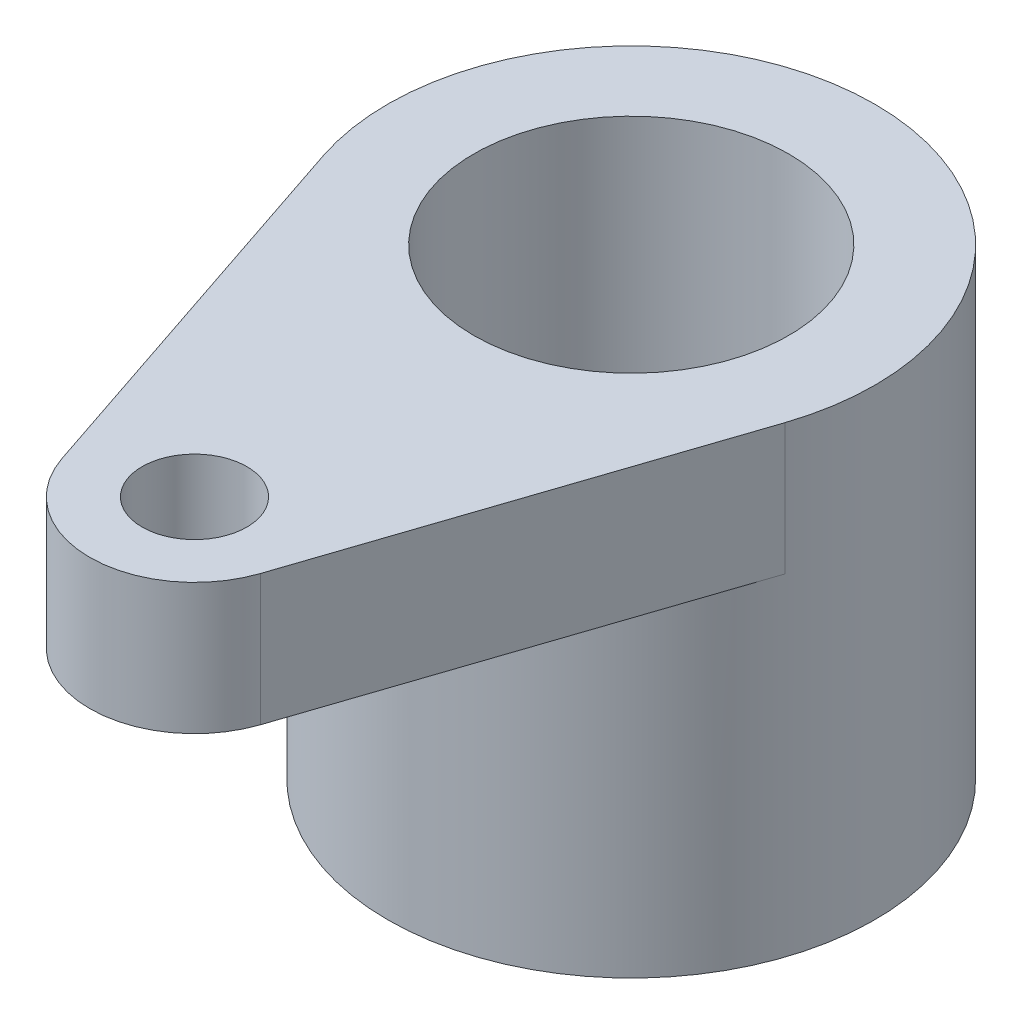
from build123d import *

# Parameters (mm, degrees)
SKETCH_1_R      = 27.880233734
SKETCH_1_R_2    = 18.02305879
EXTRUDE_1_DEPTH = 53
SKETCH_2_R      = 6
EXTRUDE_2_DEPTH = 15


with BuildPart() as part:
    # Sketch 1 → Extrude 1 (new body)
    with BuildSketch(Plane(origin=(0, 0, 0), x_dir=(1, 0, 0), z_dir=(0, 1, 0))):
        with Locations(Location((0, 0, 0), (0, 0, 270))):
            Circle(SKETCH_1_R)
        with Locations(Location((0, 0, 0), (0, 0, 270))):
            Circle(SKETCH_1_R_2, mode=Mode.SUBTRACT)
    extrude(amount=-EXTRUDE_1_DEPTH)

    # Sketch 2 → Extrude 2 (add)
    with BuildSketch(Plane(origin=(0, 0, 0), x_dir=(1, 0, 0), z_dir=(0, 1, 0))):
        with BuildLine():
            Line((-26.436684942, -8.854892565), (-11.378678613, -53.811256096))
            ThreePointArc((-11.378678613, -53.811256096), (0, -62), (11.378678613, -53.811256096))
            Line((11.378678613, -53.811256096), (26.436684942, -8.854892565))
            ThreePointArc((26.436684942, -8.854892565), (0, -27.880233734), (-26.436684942, -8.854892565))
        make_face()
        with Locations(Location((0, -50, 0), (0, 0, 270))):
            Circle(SKETCH_2_R, mode=Mode.SUBTRACT)
    extrude(amount=-EXTRUDE_2_DEPTH)


solid = part.part
